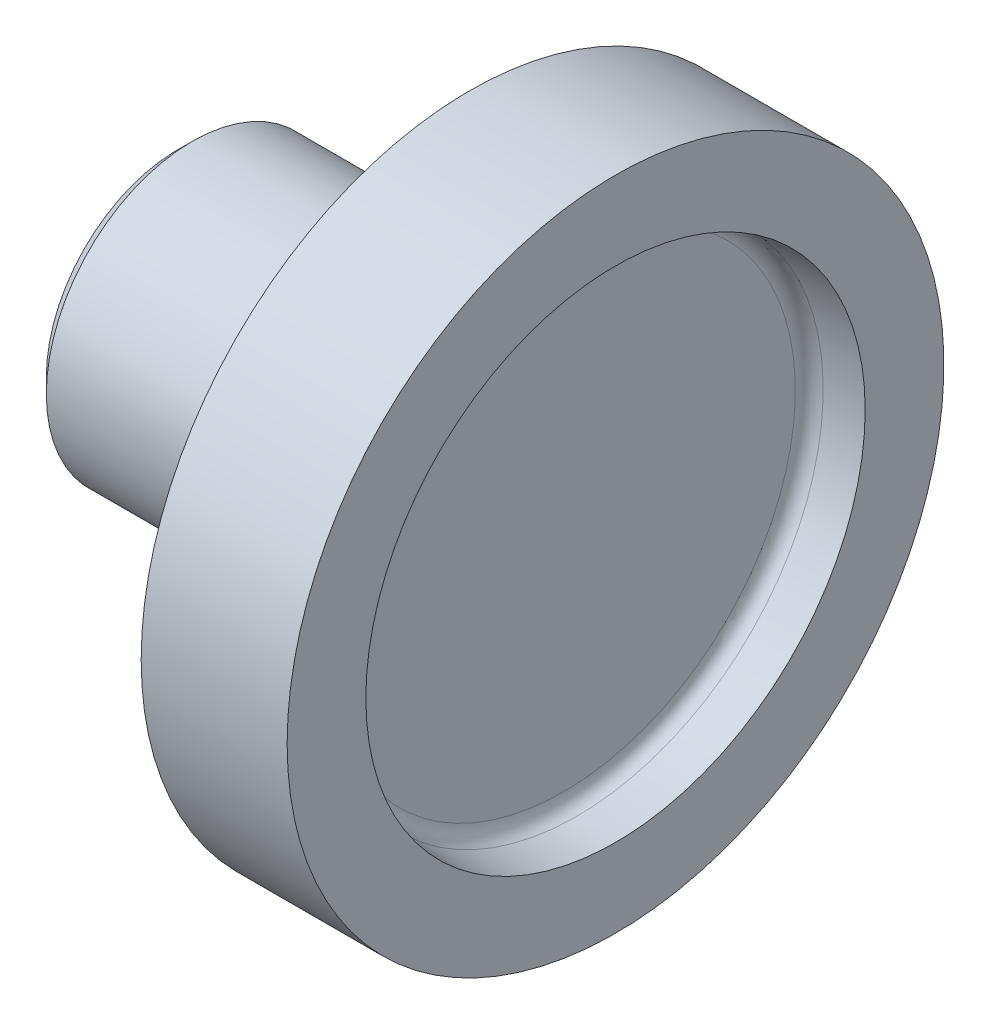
from build123d import *


with BuildPart() as part:
    # Esquisse1 → R_volution1 (revolve)
    with BuildSketch(Plane.XY, mode=Mode.PRIVATE) as r_volution1_sk:
        with BuildLine():
            Line((-23.325245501, 0), (-23.325245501, 9))
            Line((-23.325245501, 9), (-22.325245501, 10))
            Line((-22.325245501, 10), (-3.325245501, 10))
            Line((-3.325245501, 10), (-3.325245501, 22.5))
            Line((-3.325245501, 22.5), (6.674754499, 22.5))
            Line((6.674754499, 22.5), (6.674754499, 17.108459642))
            Line((6.674754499, 17.108459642), (4.027598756, 16.876863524))
            ThreePointArc((4.027598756, 16.876863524), (3.377477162, 16.556259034), (3.114754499, 15.880668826))
            Line((3.114754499, 15.880668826), (3.114754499, 0))
            Line((3.114754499, 0), (-23.325245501, 0))
        make_face()
    revolve(r_volution1_sk.sketch.rotate(Axis((-50.353437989, 0, 0), (1, 0, 0)), 90), axis=Axis((-50.353437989, 0, 0), (1, 0, 0)))


solid = part.part
